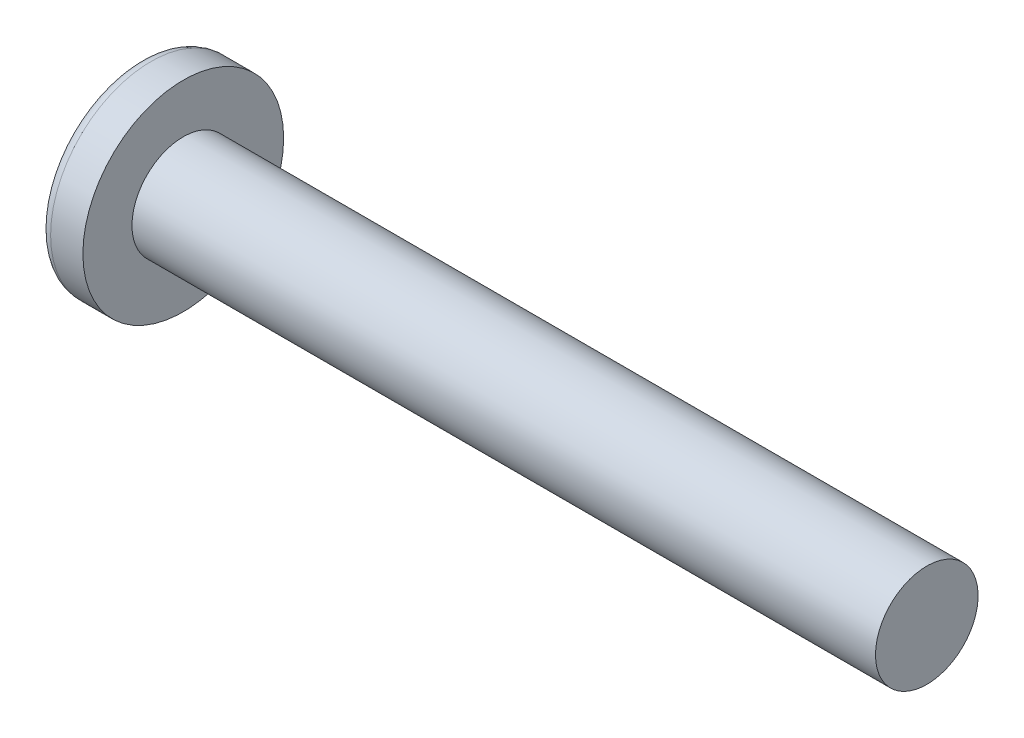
ISO-10303-21;
HEADER;
FILE_DESCRIPTION(('STEP AP214'),'2;1');
FILE_NAME('part.step','',(''),(''),'','','');
FILE_SCHEMA(('AUTOMOTIVE_DESIGN { 1 0 10303 214 1 1 1 1 }'));
ENDSEC;
DATA;
#1=APPLICATION_CONTEXT('core data for automotive mechanical design processes');
#2=APPLICATION_PROTOCOL_DEFINITION('international standard','automotive_design',2000,#1);
#3=PRODUCT_CONTEXT('',#1,'mechanical');
#4=PRODUCT('Part','Part','',(#3));
#5=PRODUCT_RELATED_PRODUCT_CATEGORY('part','',(#4));
#6=PRODUCT_DEFINITION_FORMATION('','',#4);
#7=PRODUCT_DEFINITION_CONTEXT('part definition',#1,'design');
#8=PRODUCT_DEFINITION('design','',#6,#7);
#9=PRODUCT_DEFINITION_SHAPE('','',#8);
#10=(LENGTH_UNIT() NAMED_UNIT(*) SI_UNIT(.MILLI.,.METRE.));
#11=(NAMED_UNIT(*) PLANE_ANGLE_UNIT() SI_UNIT($,.RADIAN.));
#12=(NAMED_UNIT(*) SI_UNIT($,.STERADIAN.) SOLID_ANGLE_UNIT());
#13=UNCERTAINTY_MEASURE_WITH_UNIT(LENGTH_MEASURE(1.E-05),#10,'distance_accuracy_value','');
#14=(GEOMETRIC_REPRESENTATION_CONTEXT(3) GLOBAL_UNCERTAINTY_ASSIGNED_CONTEXT((#13)) GLOBAL_UNIT_ASSIGNED_CONTEXT((#10,
#11,#12)) REPRESENTATION_CONTEXT('',''));
#15=CARTESIAN_POINT('',(0.,0.,0.));
#16=DIRECTION('',(0.,0.,1.));
#17=DIRECTION('',(1.,0.,0.));
#18=AXIS2_PLACEMENT_3D('',#15,#16,#17);
#19=CARTESIAN_POINT('',(5.60832,0.,0.));
#20=DIRECTION('',(-1.,0.,0.));
#21=DIRECTION('',(0.,1.,0.));
#22=AXIS2_PLACEMENT_3D('',#19,#20,#21);
#23=SPHERICAL_SURFACE('',#22,5.60832);
#24=CARTESIAN_POINT('',(1.05207992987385,0.,0.));
#25=DIRECTION('',(-1.,0.,0.));
#26=DIRECTION('',(0.,0.,1.));
#27=AXIS2_PLACEMENT_3D('',#24,#25,#26);
#28=CIRCLE('',#27,3.27015743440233);
#29=CARTESIAN_POINT('',(1.05207992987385,0.,3.27015743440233));
#30=VERTEX_POINT('',#29);
#31=EDGE_CURVE('E152',#30,#30,#28,.T.);
#32=ORIENTED_EDGE('',*,*,#31,.T.);
#33=EDGE_LOOP('',(#32));
#34=FACE_BOUND('',#33,.T.);
#35=CARTESIAN_POINT('',(5.60159094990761,-0.0698366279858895,0.));
#36=DIRECTION('',(-0.0959099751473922,-0.995390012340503,0.));
#37=DIRECTION('',(0.995390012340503,-0.0959099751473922,0.));
#38=AXIS2_PLACEMENT_3D('',#35,#36,#37);
#39=CIRCLE('',#38,5.60788113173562);
#40=CARTESIAN_POINT('',(0.363211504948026,0.43490305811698,1.93725306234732));
#41=VERTEX_POINT('',#40);
#42=CARTESIAN_POINT('',(0.0388806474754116,0.466153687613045,0.466153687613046));
#43=VERTEX_POINT('',#42);
#44=EDGE_CURVE('E183',#41,#43,#39,.T.);
#45=ORIENTED_EDGE('',*,*,#44,.F.);
#46=CARTESIAN_POINT('',(4.44845864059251,0.,-1.41392622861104));
#47=DIRECTION('',(0.634224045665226,0.,0.773149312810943));
#48=DIRECTION('',(0.773149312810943,0.,-0.634224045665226));
#49=AXIS2_PLACEMENT_3D('',#46,#47,#48);
#50=CIRCLE('',#49,5.30177210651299);
#51=CARTESIAN_POINT('',(0.363211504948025,-0.434903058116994,1.93725306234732));
#52=VERTEX_POINT('',#51);
#53=EDGE_CURVE('E148',#41,#52,#50,.T.);
#54=ORIENTED_EDGE('',*,*,#53,.T.);
#55=CARTESIAN_POINT('',(5.60159094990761,0.0698366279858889,0.));
#56=DIRECTION('',(-0.095909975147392,0.995390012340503,0.));
#57=DIRECTION('',(-0.995390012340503,-0.095909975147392,0.));
#58=AXIS2_PLACEMENT_3D('',#55,#56,#57);
#59=CIRCLE('',#58,5.60788113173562);
#60=CARTESIAN_POINT('',(0.0388806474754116,-0.466153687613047,0.466153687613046));
#61=VERTEX_POINT('',#60);
#62=EDGE_CURVE('E104',#61,#52,#59,.T.);
#63=ORIENTED_EDGE('',*,*,#62,.F.);
#64=CARTESIAN_POINT('',(5.60159094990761,0.,-0.0698366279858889));
#65=DIRECTION('',(-0.095909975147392,0.,-0.995390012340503));
#66=DIRECTION('',(-0.995390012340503,0.,0.095909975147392));
#67=AXIS2_PLACEMENT_3D('',#64,#65,#66);
#68=CIRCLE('',#67,5.60788113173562);
#69=CARTESIAN_POINT('',(0.363211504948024,-1.93725306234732,0.434903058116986));
#70=VERTEX_POINT('',#69);
#71=EDGE_CURVE('E129',#70,#61,#68,.T.);
#72=ORIENTED_EDGE('',*,*,#71,.F.);
#73=CARTESIAN_POINT('',(4.4484586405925,1.41392622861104,0.));
#74=DIRECTION('',(0.634224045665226,-0.773149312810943,0.));
#75=DIRECTION('',(0.773149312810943,0.634224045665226,0.));
#76=AXIS2_PLACEMENT_3D('',#73,#74,#75);
#77=CIRCLE('',#76,5.30177210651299);
#78=CARTESIAN_POINT('',(0.363211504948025,-1.93725306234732,-0.434903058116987));
#79=VERTEX_POINT('',#78);
#80=EDGE_CURVE('E137',#70,#79,#77,.T.);
#81=ORIENTED_EDGE('',*,*,#80,.T.);
#82=CARTESIAN_POINT('',(5.60159094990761,0.,0.0698366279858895));
#83=DIRECTION('',(-0.0959099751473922,0.,0.995390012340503));
#84=DIRECTION('',(0.995390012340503,0.,0.0959099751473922));
#85=AXIS2_PLACEMENT_3D('',#82,#83,#84);
#86=CIRCLE('',#85,5.60788113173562);
#87=CARTESIAN_POINT('',(0.0388806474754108,-0.466153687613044,-0.466153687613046));
#88=VERTEX_POINT('',#87);
#89=EDGE_CURVE('E47',#88,#79,#86,.T.);
#90=ORIENTED_EDGE('',*,*,#89,.F.);
#91=CARTESIAN_POINT('',(0.363211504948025,-0.43490305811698,-1.93725306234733));
#92=VERTEX_POINT('',#91);
#93=EDGE_CURVE('E190',#92,#88,#59,.T.);
#94=ORIENTED_EDGE('',*,*,#93,.F.);
#95=CARTESIAN_POINT('',(4.44845864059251,0.,1.41392622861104));
#96=DIRECTION('',(0.634224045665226,0.,-0.773149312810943));
#97=DIRECTION('',(-0.773149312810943,0.,-0.634224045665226));
#98=AXIS2_PLACEMENT_3D('',#95,#96,#97);
#99=CIRCLE('',#98,5.30177210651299);
#100=CARTESIAN_POINT('',(0.363211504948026,0.434903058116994,-1.93725306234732));
#101=VERTEX_POINT('',#100);
#102=EDGE_CURVE('E130',#92,#101,#99,.T.);
#103=ORIENTED_EDGE('',*,*,#102,.T.);
#104=CARTESIAN_POINT('',(0.0388806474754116,0.466153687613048,-0.466153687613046));
#105=VERTEX_POINT('',#104);
#106=EDGE_CURVE('E178',#105,#101,#39,.T.);
#107=ORIENTED_EDGE('',*,*,#106,.F.);
#108=CARTESIAN_POINT('',(0.363211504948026,1.93725306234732,-0.434903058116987));
#109=VERTEX_POINT('',#108);
#110=EDGE_CURVE('E40',#109,#105,#86,.T.);
#111=ORIENTED_EDGE('',*,*,#110,.F.);
#112=CARTESIAN_POINT('',(4.44845864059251,-1.41392622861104,0.));
#113=DIRECTION('',(0.634224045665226,0.773149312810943,0.));
#114=DIRECTION('',(-0.773149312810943,0.634224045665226,0.));
#115=AXIS2_PLACEMENT_3D('',#112,#113,#114);
#116=CIRCLE('',#115,5.30177210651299);
#117=CARTESIAN_POINT('',(0.363211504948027,1.93725306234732,0.434903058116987));
#118=VERTEX_POINT('',#117);
#119=EDGE_CURVE('E11',#109,#118,#116,.T.);
#120=ORIENTED_EDGE('',*,*,#119,.T.);
#121=EDGE_CURVE('E166',#43,#118,#68,.T.);
#122=ORIENTED_EDGE('',*,*,#121,.F.);
#123=EDGE_LOOP('',(#45,#54,#63,#72,#81,#90,#94,#103,#107,#111,#120,#122));
#124=FACE_BOUND('',#123,.T.);
#125=ADVANCED_FACE('F32',(#34,#124),#23,.T.);
#126=CARTESIAN_POINT('',(2.72481523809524,0.,-0.207352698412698));
#127=DIRECTION('',(-0.0959099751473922,0.,0.995390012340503));
#128=DIRECTION('',(0.995390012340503,0.,0.0959099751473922));
#129=AXIS2_PLACEMENT_3D('',#126,#127,#128);
#130=PLANE('',#129);
#131=ORIENTED_EDGE('',*,*,#110,.T.);
#132=DIRECTION('',(0.990843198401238,-0.0954718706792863,0.095471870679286));
#133=VECTOR('',#132,1.);
#134=CARTESIAN_POINT('',(2.74443031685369,0.205462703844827,-0.205462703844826));
#135=LINE('',#134,#133);
#136=CARTESIAN_POINT('',(2.4384,0.234950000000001,-0.234949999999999));
#137=VERTEX_POINT('',#136);
#138=EDGE_CURVE('E172',#105,#137,#135,.T.);
#139=ORIENTED_EDGE('',*,*,#138,.T.);
#140=DIRECTION('',(0.771012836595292,-0.632471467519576,0.0742902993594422));
#141=VECTOR('',#140,1.);
#142=CARTESIAN_POINT('',(0.,2.2352,-0.4699));
#143=LINE('',#142,#141);
#144=EDGE_CURVE('E153',#109,#137,#143,.T.);
#145=ORIENTED_EDGE('',*,*,#144,.F.);
#146=EDGE_LOOP('',(#131,#139,#145));
#147=FACE_BOUND('',#146,.T.);
#148=ADVANCED_FACE('F171',(#147),#130,.T.);
#149=DIRECTION('',(0.771012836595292,0.632471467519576,0.0742902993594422));
#150=VECTOR('',#149,1.);
#151=CARTESIAN_POINT('',(0.,-2.2352,-0.4699));
#152=LINE('',#151,#150);
#153=CARTESIAN_POINT('',(2.4384,-0.23495,-0.23495));
#154=VERTEX_POINT('',#153);
#155=EDGE_CURVE('E138',#79,#154,#152,.T.);
#156=ORIENTED_EDGE('',*,*,#155,.T.);
#157=DIRECTION('',(-0.990843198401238,-0.0954718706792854,-0.095471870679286));
#158=VECTOR('',#157,1.);
#159=CARTESIAN_POINT('',(2.74443031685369,-0.205462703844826,-0.205462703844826));
#160=LINE('',#159,#158);
#161=EDGE_CURVE('E193',#154,#88,#160,.T.);
#162=ORIENTED_EDGE('',*,*,#161,.T.);
#163=ORIENTED_EDGE('',*,*,#89,.T.);
#164=EDGE_LOOP('',(#156,#162,#163));
#165=FACE_BOUND('',#164,.T.);
#166=ADVANCED_FACE('F208',(#165),#130,.T.);
#167=CARTESIAN_POINT('',(2.72481523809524,0.,0.207352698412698));
#168=DIRECTION('',(-0.095909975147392,0.,-0.995390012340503));
#169=DIRECTION('',(-0.995390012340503,0.,0.095909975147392));
#170=AXIS2_PLACEMENT_3D('',#167,#168,#169);
#171=PLANE('',#170);
#172=DIRECTION('',(0.771012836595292,-0.632471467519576,-0.0742902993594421));
#173=VECTOR('',#172,1.);
#174=CARTESIAN_POINT('',(0.,2.2352,0.4699));
#175=LINE('',#174,#173);
#176=CARTESIAN_POINT('',(2.4384,0.23495,0.23495));
#177=VERTEX_POINT('',#176);
#178=EDGE_CURVE('E209',#118,#177,#175,.T.);
#179=ORIENTED_EDGE('',*,*,#178,.T.);
#180=DIRECTION('',(-0.990843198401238,0.0954718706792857,0.0954718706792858));
#181=VECTOR('',#180,1.);
#182=CARTESIAN_POINT('',(2.74443031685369,0.205462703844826,0.205462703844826));
#183=LINE('',#182,#181);
#184=EDGE_CURVE('E187',#177,#43,#183,.T.);
#185=ORIENTED_EDGE('',*,*,#184,.T.);
#186=ORIENTED_EDGE('',*,*,#121,.T.);
#187=EDGE_LOOP('',(#179,#185,#186));
#188=FACE_BOUND('',#187,.T.);
#189=ADVANCED_FACE('F213',(#188),#171,.T.);
#190=ORIENTED_EDGE('',*,*,#71,.T.);
#191=DIRECTION('',(0.990843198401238,0.0954718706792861,-0.0954718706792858));
#192=VECTOR('',#191,1.);
#193=CARTESIAN_POINT('',(2.74443031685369,-0.205462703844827,0.205462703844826));
#194=LINE('',#193,#192);
#195=CARTESIAN_POINT('',(2.4384,-0.234950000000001,0.234949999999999));
#196=VERTEX_POINT('',#195);
#197=EDGE_CURVE('E102',#61,#196,#194,.T.);
#198=ORIENTED_EDGE('',*,*,#197,.T.);
#199=DIRECTION('',(0.771012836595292,0.632471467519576,-0.074290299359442));
#200=VECTOR('',#199,1.);
#201=CARTESIAN_POINT('',(0.,-2.2352,0.469899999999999));
#202=LINE('',#201,#200);
#203=EDGE_CURVE('E127',#70,#196,#202,.T.);
#204=ORIENTED_EDGE('',*,*,#203,.F.);
#205=EDGE_LOOP('',(#190,#198,#204));
#206=FACE_BOUND('',#205,.T.);
#207=ADVANCED_FACE('F126',(#206),#171,.T.);
#208=CARTESIAN_POINT('',(-25.4,0.,0.));
#209=DIRECTION('',(-1.,0.,0.));
#210=DIRECTION('',(0.,0.,1.));
#211=AXIS2_PLACEMENT_3D('',#208,#209,#210);
#212=CYLINDRICAL_SURFACE('',#211,1.7526);
#213=CARTESIAN_POINT('',(27.8638,0.,0.));
#214=DIRECTION('',(-1.,0.,0.));
#215=DIRECTION('',(0.,0.,1.));
#216=AXIS2_PLACEMENT_3D('',#213,#214,#215);
#217=CIRCLE('',#216,1.7526);
#218=CARTESIAN_POINT('',(27.8638,0.,1.7526));
#219=VERTEX_POINT('',#218);
#220=EDGE_CURVE('E149',#219,#219,#217,.T.);
#221=ORIENTED_EDGE('',*,*,#220,.T.);
#222=EDGE_LOOP('',(#221));
#223=FACE_BOUND('',#222,.T.);
#224=CARTESIAN_POINT('',(2.4638,0.,0.));
#225=DIRECTION('',(-1.,0.,0.));
#226=DIRECTION('',(0.,0.,1.));
#227=AXIS2_PLACEMENT_3D('',#224,#225,#226);
#228=CIRCLE('',#227,1.7526);
#229=CARTESIAN_POINT('',(2.4638,0.,1.7526));
#230=VERTEX_POINT('',#229);
#231=EDGE_CURVE('E162',#230,#230,#228,.T.);
#232=ORIENTED_EDGE('',*,*,#231,.F.);
#233=EDGE_LOOP('',(#232));
#234=FACE_BOUND('',#233,.T.);
#235=ADVANCED_FACE('F34',(#223,#234),#212,.T.);
#236=CARTESIAN_POINT('',(2.4638,1.7526,0.));
#237=DIRECTION('',(-1.,0.,0.));
#238=DIRECTION('',(0.,0.,1.));
#239=AXIS2_PLACEMENT_3D('',#236,#237,#238);
#240=PLANE('',#239);
#241=CARTESIAN_POINT('',(2.4638,0.,0.));
#242=DIRECTION('',(-1.,0.,0.));
#243=DIRECTION('',(0.,0.,1.));
#244=AXIS2_PLACEMENT_3D('',#241,#242,#243);
#245=CIRCLE('',#244,3.429);
#246=CARTESIAN_POINT('',(2.4638,0.,3.429));
#247=VERTEX_POINT('',#246);
#248=EDGE_CURVE('E159',#247,#247,#245,.T.);
#249=ORIENTED_EDGE('',*,*,#248,.F.);
#250=EDGE_LOOP('',(#249));
#251=FACE_BOUND('',#250,.T.);
#252=ORIENTED_EDGE('',*,*,#231,.T.);
#253=EDGE_LOOP('',(#252));
#254=FACE_BOUND('',#253,.T.);
#255=ADVANCED_FACE('F241',(#251,#254),#240,.F.);
#256=CARTESIAN_POINT('',(-25.4,0.,0.));
#257=DIRECTION('',(-1.,0.,0.));
#258=DIRECTION('',(0.,0.,1.));
#259=AXIS2_PLACEMENT_3D('',#256,#257,#258);
#260=CYLINDRICAL_SURFACE('',#259,3.429);
#261=ORIENTED_EDGE('',*,*,#248,.T.);
#262=EDGE_LOOP('',(#261));
#263=FACE_BOUND('',#262,.T.);
#264=CARTESIAN_POINT('',(1.3616071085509,0.,0.));
#265=DIRECTION('',(-1.,0.,0.));
#266=DIRECTION('',(0.,0.,1.));
#267=AXIS2_PLACEMENT_3D('',#264,#265,#266);
#268=CIRCLE('',#267,3.429);
#269=CARTESIAN_POINT('',(1.3616071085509,0.,3.429));
#270=VERTEX_POINT('',#269);
#271=EDGE_CURVE('E156',#270,#270,#268,.T.);
#272=ORIENTED_EDGE('',*,*,#271,.F.);
#273=EDGE_LOOP('',(#272));
#274=FACE_BOUND('',#273,.T.);
#275=ADVANCED_FACE('F238',(#263,#274),#260,.T.);
#276=CARTESIAN_POINT('',(1.3616071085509,0.,0.));
#277=DIRECTION('',(-1.,0.,0.));
#278=DIRECTION('',(0.,0.,1.));
#279=AXIS2_PLACEMENT_3D('',#276,#277,#278);
#280=TOROIDAL_SURFACE('',#279,3.048,0.380999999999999);
#281=ORIENTED_EDGE('',*,*,#271,.T.);
#282=EDGE_LOOP('',(#281));
#283=FACE_BOUND('',#282,.T.);
#284=ORIENTED_EDGE('',*,*,#31,.F.);
#285=EDGE_LOOP('',(#284));
#286=FACE_BOUND('',#285,.T.);
#287=ADVANCED_FACE('F235',(#283,#286),#280,.T.);
#288=CARTESIAN_POINT('',(27.8638,1.7526,0.));
#289=DIRECTION('',(1.,0.,0.));
#290=DIRECTION('',(0.,0.,-1.));
#291=AXIS2_PLACEMENT_3D('',#288,#289,#290);
#292=PLANE('',#291);
#293=ORIENTED_EDGE('',*,*,#220,.F.);
#294=EDGE_LOOP('',(#293));
#295=FACE_BOUND('',#294,.T.);
#296=ADVANCED_FACE('F233',(#295),#292,.T.);
#297=CARTESIAN_POINT('',(0.,2.2352,0.4699));
#298=DIRECTION('',(0.634224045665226,0.773149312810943,0.));
#299=DIRECTION('',(-0.773149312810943,0.634224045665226,0.));
#300=AXIS2_PLACEMENT_3D('',#297,#298,#299);
#301=PLANE('',#300);
#302=ORIENTED_EDGE('',*,*,#144,.T.);
#303=DIRECTION('',(0.,0.,-1.));
#304=VECTOR('',#303,1.);
#305=CARTESIAN_POINT('',(2.4384,0.23495,0.23495));
#306=LINE('',#305,#304);
#307=EDGE_CURVE('E120',#177,#137,#306,.T.);
#308=ORIENTED_EDGE('',*,*,#307,.F.);
#309=ORIENTED_EDGE('',*,*,#178,.F.);
#310=ORIENTED_EDGE('',*,*,#119,.F.);
#311=EDGE_LOOP('',(#302,#308,#309,#310));
#312=FACE_BOUND('',#311,.T.);
#313=ADVANCED_FACE('F212',(#312),#301,.F.);
#314=CARTESIAN_POINT('',(2.4384,-0.23495,-0.23495));
#315=DIRECTION('',(0.634224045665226,-0.773149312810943,0.));
#316=DIRECTION('',(0.773149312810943,0.634224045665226,0.));
#317=AXIS2_PLACEMENT_3D('',#314,#315,#316);
#318=PLANE('',#317);
#319=ORIENTED_EDGE('',*,*,#203,.T.);
#320=DIRECTION('',(0.,0.,1.));
#321=VECTOR('',#320,1.);
#322=CARTESIAN_POINT('',(2.4384,-0.23495,-0.23495));
#323=LINE('',#322,#321);
#324=EDGE_CURVE('E119',#154,#196,#323,.T.);
#325=ORIENTED_EDGE('',*,*,#324,.F.);
#326=ORIENTED_EDGE('',*,*,#155,.F.);
#327=ORIENTED_EDGE('',*,*,#80,.F.);
#328=EDGE_LOOP('',(#319,#325,#326,#327));
#329=FACE_BOUND('',#328,.T.);
#330=ADVANCED_FACE('F134',(#329),#318,.F.);
#331=CARTESIAN_POINT('',(2.4384,0.23495,-0.23495));
#332=DIRECTION('',(-1.,0.,0.));
#333=DIRECTION('',(0.,0.,1.));
#334=AXIS2_PLACEMENT_3D('',#331,#332,#333);
#335=PLANE('',#334);
#336=DIRECTION('',(0.,1.,0.));
#337=VECTOR('',#336,1.);
#338=CARTESIAN_POINT('',(2.4384,-0.23495,-0.23495));
#339=LINE('',#338,#337);
#340=EDGE_CURVE('E142',#154,#137,#339,.T.);
#341=ORIENTED_EDGE('',*,*,#340,.F.);
#342=ORIENTED_EDGE('',*,*,#324,.T.);
#343=DIRECTION('',(0.,-1.,0.));
#344=VECTOR('',#343,1.);
#345=CARTESIAN_POINT('',(2.4384,0.23495,0.23495));
#346=LINE('',#345,#344);
#347=EDGE_CURVE('E111',#177,#196,#346,.T.);
#348=ORIENTED_EDGE('',*,*,#347,.F.);
#349=ORIENTED_EDGE('',*,*,#307,.T.);
#350=EDGE_LOOP('',(#341,#342,#348,#349));
#351=FACE_BOUND('',#350,.T.);
#352=ADVANCED_FACE('F140',(#351),#335,.T.);
#353=CARTESIAN_POINT('',(2.4384,0.234950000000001,-0.234949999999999));
#354=DIRECTION('',(0.634224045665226,0.,-0.773149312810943));
#355=DIRECTION('',(0.773149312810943,0.,0.634224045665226));
#356=AXIS2_PLACEMENT_3D('',#353,#354,#355);
#357=PLANE('',#356);
#358=DIRECTION('',(0.771012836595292,0.0742902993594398,0.632471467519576));
#359=VECTOR('',#358,1.);
#360=CARTESIAN_POINT('',(0.,-0.469899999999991,-2.2352));
#361=LINE('',#360,#359);
#362=EDGE_CURVE('E198',#92,#154,#361,.T.);
#363=ORIENTED_EDGE('',*,*,#362,.T.);
#364=ORIENTED_EDGE('',*,*,#340,.T.);
#365=DIRECTION('',(0.771012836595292,-0.0742902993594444,0.632471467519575));
#366=VECTOR('',#365,1.);
#367=CARTESIAN_POINT('',(0.,0.469900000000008,-2.2352));
#368=LINE('',#367,#366);
#369=EDGE_CURVE('E108',#101,#137,#368,.T.);
#370=ORIENTED_EDGE('',*,*,#369,.F.);
#371=ORIENTED_EDGE('',*,*,#102,.F.);
#372=EDGE_LOOP('',(#363,#364,#370,#371));
#373=FACE_BOUND('',#372,.T.);
#374=ADVANCED_FACE('F203',(#373),#357,.F.);
#375=CARTESIAN_POINT('',(2.72481523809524,-0.207352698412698,0.));
#376=DIRECTION('',(-0.095909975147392,0.995390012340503,0.));
#377=DIRECTION('',(-0.995390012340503,-0.095909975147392,0.));
#378=AXIS2_PLACEMENT_3D('',#375,#376,#377);
#379=PLANE('',#378);
#380=ORIENTED_EDGE('',*,*,#93,.T.);
#381=ORIENTED_EDGE('',*,*,#161,.F.);
#382=ORIENTED_EDGE('',*,*,#362,.F.);
#383=EDGE_LOOP('',(#380,#381,#382));
#384=FACE_BOUND('',#383,.T.);
#385=ADVANCED_FACE('F207',(#384),#379,.T.);
#386=CARTESIAN_POINT('',(2.72481523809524,0.207352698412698,0.));
#387=DIRECTION('',(-0.0959099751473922,-0.995390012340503,0.));
#388=DIRECTION('',(0.995390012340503,-0.0959099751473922,0.));
#389=AXIS2_PLACEMENT_3D('',#386,#387,#388);
#390=PLANE('',#389);
#391=ORIENTED_EDGE('',*,*,#106,.T.);
#392=ORIENTED_EDGE('',*,*,#369,.T.);
#393=ORIENTED_EDGE('',*,*,#138,.F.);
#394=EDGE_LOOP('',(#391,#392,#393));
#395=FACE_BOUND('',#394,.T.);
#396=ADVANCED_FACE('F201',(#395),#390,.T.);
#397=CARTESIAN_POINT('',(0.,-0.469900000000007,2.2352));
#398=DIRECTION('',(0.634224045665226,0.,0.773149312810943));
#399=DIRECTION('',(-0.773149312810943,0.,0.634224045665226));
#400=AXIS2_PLACEMENT_3D('',#397,#398,#399);
#401=PLANE('',#400);
#402=DIRECTION('',(0.771012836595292,-0.07429029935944,-0.632471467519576));
#403=VECTOR('',#402,1.);
#404=CARTESIAN_POINT('',(0.,0.469899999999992,2.2352));
#405=LINE('',#404,#403);
#406=EDGE_CURVE('E107',#41,#177,#405,.T.);
#407=ORIENTED_EDGE('',*,*,#406,.T.);
#408=ORIENTED_EDGE('',*,*,#347,.T.);
#409=DIRECTION('',(0.771012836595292,0.0742902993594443,-0.632471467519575));
#410=VECTOR('',#409,1.);
#411=CARTESIAN_POINT('',(0.,-0.469900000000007,2.2352));
#412=LINE('',#411,#410);
#413=EDGE_CURVE('E98',#52,#196,#412,.T.);
#414=ORIENTED_EDGE('',*,*,#413,.F.);
#415=ORIENTED_EDGE('',*,*,#53,.F.);
#416=EDGE_LOOP('',(#407,#408,#414,#415));
#417=FACE_BOUND('',#416,.T.);
#418=ADVANCED_FACE('F112',(#417),#401,.F.);
#419=ORIENTED_EDGE('',*,*,#44,.T.);
#420=ORIENTED_EDGE('',*,*,#184,.F.);
#421=ORIENTED_EDGE('',*,*,#406,.F.);
#422=EDGE_LOOP('',(#419,#420,#421));
#423=FACE_BOUND('',#422,.T.);
#424=ADVANCED_FACE('F214',(#423),#390,.T.);
#425=ORIENTED_EDGE('',*,*,#62,.T.);
#426=ORIENTED_EDGE('',*,*,#413,.T.);
#427=ORIENTED_EDGE('',*,*,#197,.F.);
#428=EDGE_LOOP('',(#425,#426,#427));
#429=FACE_BOUND('',#428,.T.);
#430=ADVANCED_FACE('F100',(#429),#379,.T.);
#431=CLOSED_SHELL('',(#125,#148,#166,#189,#207,#235,#255,#275,#287,#296,#313,#330,#352,#374,
#385,#396,#418,#424,#430));
#432=MANIFOLD_SOLID_BREP('B2',#431);
#433=ADVANCED_BREP_SHAPE_REPRESENTATION('',(#18,#432),#14);
#434=SHAPE_DEFINITION_REPRESENTATION(#9,#433);
ENDSEC;
END-ISO-10303-21;
